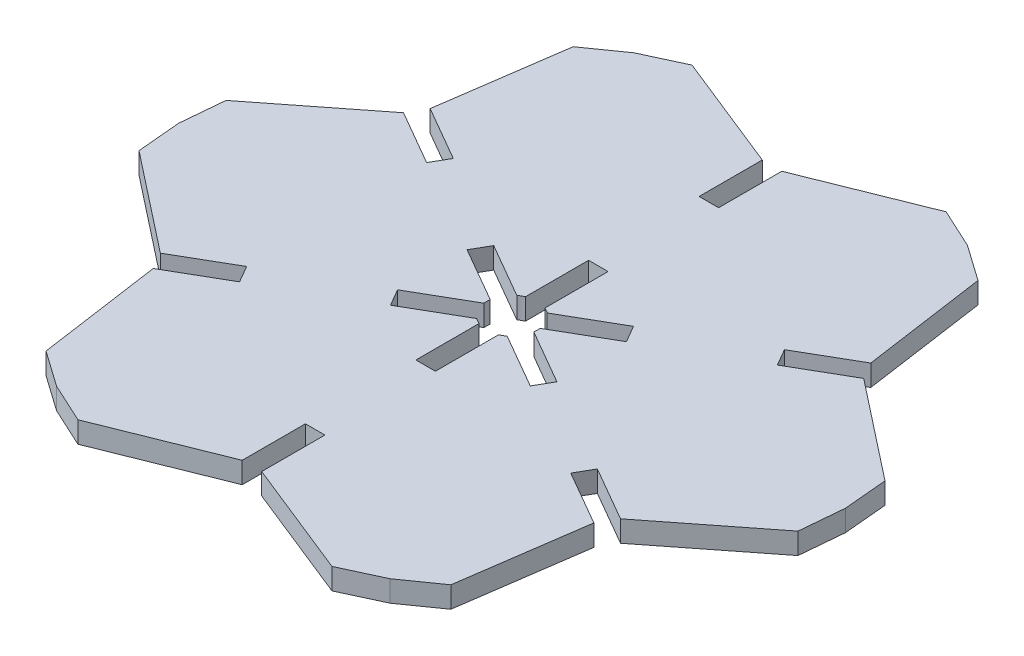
from build123d import *

# Parameters (mm, degrees)
CROQUIS1_R              = 39.9625
CROQUIS1_R_2            = 2.9625
SALIENTE_EXTRUIR1_DEPTH = 1.25
CORTAR_EXTRUIR2_DEPTH   = 57.570777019
MATRIZC1_COUNT          = 6


with BuildPart() as part:
    # Croquis1 → Saliente-Extruir1 (new, symmetric)
    with BuildSketch(Plane(origin=(0, 0, 0), x_dir=(1, 0, 0), z_dir=(0, 1, 0))):
        with Locations(Location((0, 0, 0), (0, 0, 270))):
            Circle(CROQUIS1_R)
        with Locations(Location((0, 0, 0), (0, 0, 270))):
            Circle(CROQUIS1_R_2, mode=Mode.SUBTRACT)
    extrude(amount=SALIENTE_EXTRUIR1_DEPTH, both=True)

    # Croquis2 → Cortar-Extruir2 (cut, symmetric)
    with BuildSketch(Plane(origin=(0, 1.25, 0), x_dir=(1, 0, 0), z_dir=(0, 1, 0))):
        Polygon((-29.082429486, 103.211352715), (29.082429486, 103.211352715), (29.082429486, 27.408277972), (16, 36.619686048), (1.15, 30.663386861), (1.15, 23.211352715), (-1.15, 23.211352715), (-1.15, 30.663386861), (-16, 36.619686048), (-29.082429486, 27.408277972), align=None)
        with BuildLine():
            Line((-1.15, 2.730184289), (-1.15, 10.182218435))
            Line((-1.15, 10.182218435), (1.15, 10.182218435))
            Line((1.15, 10.182218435), (1.15, 2.730184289))
            ThreePointArc((1.15, 2.730184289), (0, 2.9625), (-1.15, 2.730184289))
        make_face()
    cortar_extruir2 = extrude(amount=CORTAR_EXTRUIR2_DEPTH, both=True, mode=Mode.SUBTRACT)

    # MatrizC1: Cortar-Extruir2 ×6 about axis
    matrizc1_axis = Axis((0, 0, 0), (0, 1, 0))
    for i in range(1, MATRIZC1_COUNT):
        add(cortar_extruir2.rotate(matrizc1_axis, i * 360 / MATRIZC1_COUNT), mode=Mode.SUBTRACT)


solid = part.part
